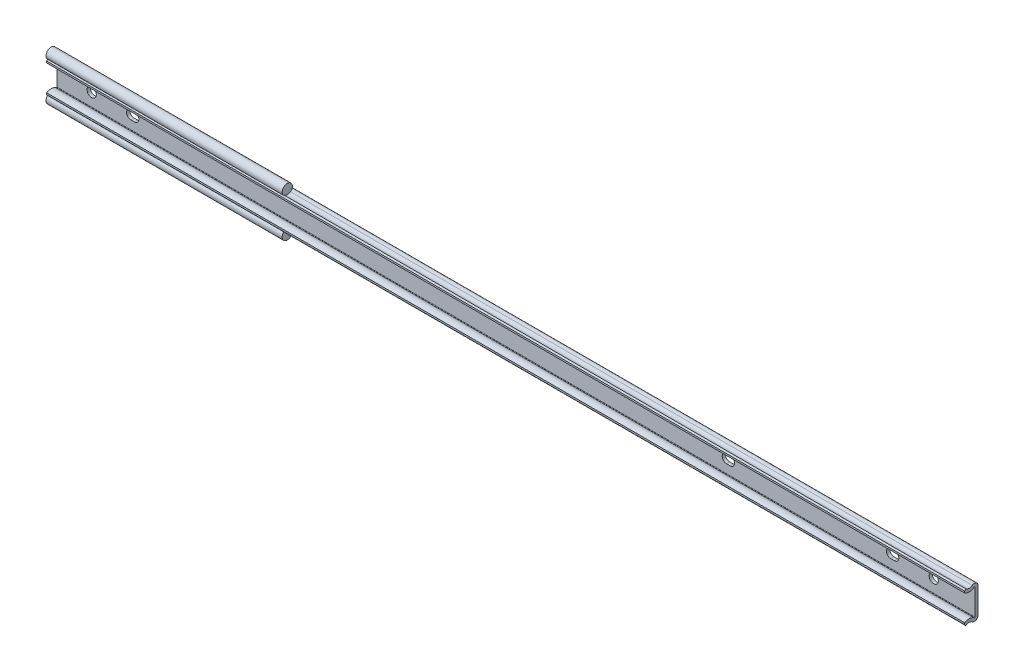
ISO-10303-21;
HEADER;
FILE_DESCRIPTION(('STEP AP214'),'2;1');
FILE_NAME('part.step','',(''),(''),'','','');
FILE_SCHEMA(('AUTOMOTIVE_DESIGN { 1 0 10303 214 1 1 1 1 }'));
ENDSEC;
DATA;
#1=APPLICATION_CONTEXT('core data for automotive mechanical design processes');
#2=APPLICATION_PROTOCOL_DEFINITION('international standard','automotive_design',2000,#1);
#3=PRODUCT_CONTEXT('',#1,'mechanical');
#4=PRODUCT('Part','Part','',(#3));
#5=PRODUCT_RELATED_PRODUCT_CATEGORY('part','',(#4));
#6=PRODUCT_DEFINITION_FORMATION('','',#4);
#7=PRODUCT_DEFINITION_CONTEXT('part definition',#1,'design');
#8=PRODUCT_DEFINITION('design','',#6,#7);
#9=PRODUCT_DEFINITION_SHAPE('','',#8);
#10=(LENGTH_UNIT() NAMED_UNIT(*) SI_UNIT(.MILLI.,.METRE.));
#11=(NAMED_UNIT(*) PLANE_ANGLE_UNIT() SI_UNIT($,.RADIAN.));
#12=(NAMED_UNIT(*) SI_UNIT($,.STERADIAN.) SOLID_ANGLE_UNIT());
#13=UNCERTAINTY_MEASURE_WITH_UNIT(LENGTH_MEASURE(1.E-05),#10,'distance_accuracy_value','');
#14=(GEOMETRIC_REPRESENTATION_CONTEXT(3) GLOBAL_UNCERTAINTY_ASSIGNED_CONTEXT((#13)) GLOBAL_UNIT_ASSIGNED_CONTEXT((#10,
#11,#12)) REPRESENTATION_CONTEXT('',''));
#15=CARTESIAN_POINT('',(0.,0.,0.));
#16=DIRECTION('',(0.,0.,1.));
#17=DIRECTION('',(1.,0.,0.));
#18=AXIS2_PLACEMENT_3D('',#15,#16,#17);
#19=CARTESIAN_POINT('',(430.,9.66999972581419,4.30999993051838));
#20=DIRECTION('',(-1.,0.,0.));
#21=DIRECTION('',(0.,0.,1.));
#22=AXIS2_PLACEMENT_3D('',#19,#20,#21);
#23=CYLINDRICAL_SURFACE('',#22,2.48000011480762);
#24=CARTESIAN_POINT('',(98.,9.66999972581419,4.3099999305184));
#25=DIRECTION('',(-1.,0.,0.));
#26=DIRECTION('',(0.,0.,1.));
#27=AXIS2_PLACEMENT_3D('',#24,#25,#26);
#28=CIRCLE('',#27,2.48000011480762);
#29=CARTESIAN_POINT('',(98.,7.77020940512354,5.90411325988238));
#30=VERTEX_POINT('',#29);
#31=CARTESIAN_POINT('',(98.,7.69573912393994,2.80910165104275));
#32=VERTEX_POINT('',#31);
#33=EDGE_CURVE('E251',#30,#32,#28,.F.);
#34=ORIENTED_EDGE('',*,*,#33,.F.);
#35=DIRECTION('',(-1.,0.,0.));
#36=VECTOR('',#35,1.);
#37=CARTESIAN_POINT('',(430.,7.77020940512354,5.90411325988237));
#38=LINE('',#37,#36);
#39=CARTESIAN_POINT('',(430.,7.77020940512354,5.90411325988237));
#40=VERTEX_POINT('',#39);
#41=EDGE_CURVE('E415',#40,#30,#38,.T.);
#42=ORIENTED_EDGE('',*,*,#41,.F.);
#43=CARTESIAN_POINT('',(430.,9.66999972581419,4.30999993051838));
#44=DIRECTION('',(-1.,0.,0.));
#45=DIRECTION('',(0.,0.,-1.));
#46=AXIS2_PLACEMENT_3D('',#43,#44,#45);
#47=CIRCLE('',#46,2.48000011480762);
#48=CARTESIAN_POINT('',(430.,7.69573912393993,2.80910165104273));
#49=VERTEX_POINT('',#48);
#50=EDGE_CURVE('E389',#49,#40,#47,.T.);
#51=ORIENTED_EDGE('',*,*,#50,.F.);
#52=DIRECTION('',(-1.,0.,0.));
#53=VECTOR('',#52,1.);
#54=CARTESIAN_POINT('',(430.,7.69573912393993,2.80910165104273));
#55=LINE('',#54,#53);
#56=EDGE_CURVE('E418',#49,#32,#55,.T.);
#57=ORIENTED_EDGE('',*,*,#56,.T.);
#58=EDGE_LOOP('',(#34,#42,#51,#57));
#59=FACE_BOUND('',#58,.T.);
#60=ADVANCED_FACE('F14',(#59),#23,.F.);
#61=CARTESIAN_POINT('',(430.,-9.66999990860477,4.30999993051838));
#62=DIRECTION('',(-1.,0.,0.));
#63=DIRECTION('',(0.,0.,1.));
#64=AXIS2_PLACEMENT_3D('',#61,#62,#63);
#65=CYLINDRICAL_SURFACE('',#64,4.03000011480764);
#66=DIRECTION('',(-1.,0.,0.));
#67=VECTOR('',#66,1.);
#68=CARTESIAN_POINT('',(430.,-6.46182654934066,1.87104018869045));
#69=LINE('',#68,#67);
#70=CARTESIAN_POINT('',(430.,-6.46182654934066,1.87104018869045));
#71=VERTEX_POINT('',#70);
#72=CARTESIAN_POINT('',(-17.,-6.46182654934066,1.87104018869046));
#73=VERTEX_POINT('',#72);
#74=EDGE_CURVE('E403',#71,#73,#69,.T.);
#75=ORIENTED_EDGE('',*,*,#74,.T.);
#76=CARTESIAN_POINT('',(-17.,-9.66999990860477,4.3099999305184));
#77=DIRECTION('',(-1.,0.,0.));
#78=DIRECTION('',(0.,0.,1.));
#79=AXIS2_PLACEMENT_3D('',#76,#77,#78);
#80=CIRCLE('',#79,4.03000011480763);
#81=CARTESIAN_POINT('',(-17.,-6.26775055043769,6.4699999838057));
#82=VERTEX_POINT('',#81);
#83=EDGE_CURVE('E259',#82,#73,#80,.T.);
#84=ORIENTED_EDGE('',*,*,#83,.F.);
#85=DIRECTION('',(-1.,0.,0.));
#86=VECTOR('',#85,1.);
#87=CARTESIAN_POINT('',(430.,-6.26775055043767,6.4699999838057));
#88=LINE('',#87,#86);
#89=CARTESIAN_POINT('',(430.,-6.26775055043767,6.4699999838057));
#90=VERTEX_POINT('',#89);
#91=EDGE_CURVE('E433',#90,#82,#88,.T.);
#92=ORIENTED_EDGE('',*,*,#91,.F.);
#93=CARTESIAN_POINT('',(430.,-9.66999990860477,4.30999993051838));
#94=DIRECTION('',(1.,0.,0.));
#95=DIRECTION('',(0.,0.,1.));
#96=AXIS2_PLACEMENT_3D('',#93,#94,#95);
#97=CIRCLE('',#96,4.03000011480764);
#98=EDGE_CURVE('E374',#71,#90,#97,.T.);
#99=ORIENTED_EDGE('',*,*,#98,.F.);
#100=EDGE_LOOP('',(#75,#84,#92,#99));
#101=FACE_BOUND('',#100,.T.);
#102=ADVANCED_FACE('F16',(#101),#65,.T.);
#103=CARTESIAN_POINT('',(430.,-6.26775055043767,6.4699999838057));
#104=DIRECTION('',(0.,0.,-1.));
#105=DIRECTION('',(-1.,0.,0.));
#106=AXIS2_PLACEMENT_3D('',#103,#104,#105);
#107=PLANE('',#106);
#108=ORIENTED_EDGE('',*,*,#91,.T.);
#109=DIRECTION('',(0.,1.,0.));
#110=VECTOR('',#109,1.);
#111=CARTESIAN_POINT('',(-17.,-7.09581181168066,6.46999998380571));
#112=LINE('',#111,#110);
#113=CARTESIAN_POINT('',(-17.,-7.09581181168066,6.46999998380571));
#114=VERTEX_POINT('',#113);
#115=EDGE_CURVE('E289',#114,#82,#112,.T.);
#116=ORIENTED_EDGE('',*,*,#115,.F.);
#117=DIRECTION('',(-1.,0.,0.));
#118=VECTOR('',#117,1.);
#119=CARTESIAN_POINT('',(430.,-7.09581181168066,6.4699999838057));
#120=LINE('',#119,#118);
#121=CARTESIAN_POINT('',(430.,-7.09581181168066,6.4699999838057));
#122=VERTEX_POINT('',#121);
#123=EDGE_CURVE('E431',#122,#114,#120,.T.);
#124=ORIENTED_EDGE('',*,*,#123,.F.);
#125=DIRECTION('',(0.,-1.,0.));
#126=VECTOR('',#125,1.);
#127=CARTESIAN_POINT('',(430.,-6.26775055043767,6.4699999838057));
#128=LINE('',#127,#126);
#129=EDGE_CURVE('E377',#90,#122,#128,.T.);
#130=ORIENTED_EDGE('',*,*,#129,.F.);
#131=EDGE_LOOP('',(#108,#116,#124,#130));
#132=FACE_BOUND('',#131,.T.);
#133=ADVANCED_FACE('F509',(#132),#107,.F.);
#134=CARTESIAN_POINT('',(430.,-7.77020958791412,5.90411325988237));
#135=DIRECTION('',(0.,0.642787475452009,-0.766044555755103));
#136=DIRECTION('',(0.,0.766044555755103,0.642787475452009));
#137=AXIS2_PLACEMENT_3D('',#134,#135,#136);
#138=PLANE('',#137);
#139=DIRECTION('',(0.,0.7660445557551,0.642787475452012));
#140=VECTOR('',#139,1.);
#141=CARTESIAN_POINT('',(-17.,-7.77020958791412,5.90411325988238));
#142=LINE('',#141,#140);
#143=CARTESIAN_POINT('',(-17.,-7.65539913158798,6.00045063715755));
#144=VERTEX_POINT('',#143);
#145=EDGE_CURVE('E234',#144,#114,#142,.T.);
#146=ORIENTED_EDGE('',*,*,#145,.F.);
#147=DIRECTION('',(-1.,0.,0.));
#148=VECTOR('',#147,1.);
#149=CARTESIAN_POINT('',(98.,-7.65539913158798,6.00045063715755));
#150=LINE('',#149,#148);
#151=CARTESIAN_POINT('',(98.,-7.65539913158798,6.00045063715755));
#152=VERTEX_POINT('',#151);
#153=EDGE_CURVE('E225',#144,#152,#150,.F.);
#154=ORIENTED_EDGE('',*,*,#153,.T.);
#155=DIRECTION('',(0.,-0.766044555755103,-0.642787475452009));
#156=VECTOR('',#155,1.);
#157=CARTESIAN_POINT('',(98.,-7.77020958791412,5.90411325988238));
#158=LINE('',#157,#156);
#159=CARTESIAN_POINT('',(98.,-7.77020958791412,5.90411325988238));
#160=VERTEX_POINT('',#159);
#161=EDGE_CURVE('E211',#152,#160,#158,.T.);
#162=ORIENTED_EDGE('',*,*,#161,.T.);
#163=DIRECTION('',(-1.,0.,0.));
#164=VECTOR('',#163,1.);
#165=CARTESIAN_POINT('',(430.,-7.77020958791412,5.90411325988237));
#166=LINE('',#165,#164);
#167=CARTESIAN_POINT('',(430.,-7.77020958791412,5.90411325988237));
#168=VERTEX_POINT('',#167);
#169=EDGE_CURVE('E429',#168,#160,#166,.T.);
#170=ORIENTED_EDGE('',*,*,#169,.F.);
#171=DIRECTION('',(0.,-0.766044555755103,-0.642787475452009));
#172=VECTOR('',#171,1.);
#173=CARTESIAN_POINT('',(430.,-7.77020958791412,5.90411325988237));
#174=LINE('',#173,#172);
#175=EDGE_CURVE('E379',#122,#168,#174,.T.);
#176=ORIENTED_EDGE('',*,*,#175,.F.);
#177=ORIENTED_EDGE('',*,*,#123,.T.);
#178=EDGE_LOOP('',(#146,#154,#162,#170,#176,#177));
#179=FACE_BOUND('',#178,.T.);
#180=ADVANCED_FACE('F232',(#179),#138,.F.);
#181=CARTESIAN_POINT('',(430.,-9.66999990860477,4.30999993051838));
#182=DIRECTION('',(-1.,0.,0.));
#183=DIRECTION('',(0.,0.,1.));
#184=AXIS2_PLACEMENT_3D('',#181,#182,#183);
#185=CYLINDRICAL_SURFACE('',#184,2.48000011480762);
#186=ORIENTED_EDGE('',*,*,#169,.T.);
#187=CARTESIAN_POINT('',(98.,-9.66999990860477,4.3099999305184));
#188=DIRECTION('',(1.,0.,0.));
#189=DIRECTION('',(0.,0.,-1.));
#190=AXIS2_PLACEMENT_3D('',#187,#188,#189);
#191=CIRCLE('',#190,2.48000011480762);
#192=CARTESIAN_POINT('',(98.,-7.69573930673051,2.80910165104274));
#193=VERTEX_POINT('',#192);
#194=EDGE_CURVE('E216',#160,#193,#191,.F.);
#195=ORIENTED_EDGE('',*,*,#194,.T.);
#196=DIRECTION('',(-1.,0.,0.));
#197=VECTOR('',#196,1.);
#198=CARTESIAN_POINT('',(430.,-7.69573930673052,2.80910165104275));
#199=LINE('',#198,#197);
#200=CARTESIAN_POINT('',(430.,-7.69573930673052,2.80910165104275));
#201=VERTEX_POINT('',#200);
#202=EDGE_CURVE('E426',#201,#193,#199,.T.);
#203=ORIENTED_EDGE('',*,*,#202,.F.);
#204=CARTESIAN_POINT('',(430.,-9.66999990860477,4.30999993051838));
#205=DIRECTION('',(-1.,0.,0.));
#206=DIRECTION('',(0.,0.,1.));
#207=AXIS2_PLACEMENT_3D('',#204,#205,#206);
#208=CIRCLE('',#207,2.48000011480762);
#209=EDGE_CURVE('E381',#168,#201,#208,.T.);
#210=ORIENTED_EDGE('',*,*,#209,.F.);
#211=EDGE_LOOP('',(#186,#195,#203,#210));
#212=FACE_BOUND('',#211,.T.);
#213=ADVANCED_FACE('F516',(#212),#185,.F.);
#214=CARTESIAN_POINT('',(430.,-6.302612,1.74999999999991));
#215=DIRECTION('',(-1.,0.,0.));
#216=DIRECTION('',(0.,0.,1.));
#217=AXIS2_PLACEMENT_3D('',#214,#215,#216);
#218=CYLINDRICAL_SURFACE('',#217,1.74999999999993);
#219=CARTESIAN_POINT('',(98.,-6.302612,1.74999999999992));
#220=DIRECTION('',(1.,0.,0.));
#221=DIRECTION('',(0.,0.,-1.));
#222=AXIS2_PLACEMENT_3D('',#219,#220,#221);
#223=CIRCLE('',#222,1.74999999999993);
#224=CARTESIAN_POINT('',(98.,-7.94495173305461,2.3543345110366));
#225=VERTEX_POINT('',#224);
#226=EDGE_CURVE('E9',#193,#225,#223,.T.);
#227=ORIENTED_EDGE('',*,*,#226,.T.);
#228=DIRECTION('',(-1.,0.,0.));
#229=VECTOR('',#228,1.);
#230=CARTESIAN_POINT('',(40.5,-7.94495173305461,2.3543345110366));
#231=LINE('',#230,#229);
#232=CARTESIAN_POINT('',(-17.,-7.94495173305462,2.35433451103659));
#233=VERTEX_POINT('',#232);
#234=EDGE_CURVE('E228',#225,#233,#231,.T.);
#235=ORIENTED_EDGE('',*,*,#234,.T.);
#236=CARTESIAN_POINT('',(-17.,-6.302612,1.74999999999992));
#237=DIRECTION('',(-1.,0.,0.));
#238=DIRECTION('',(0.,0.,1.));
#239=AXIS2_PLACEMENT_3D('',#236,#237,#238);
#240=CIRCLE('',#239,1.74999999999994);
#241=CARTESIAN_POINT('',(-17.,-6.302612,0.));
#242=VERTEX_POINT('',#241);
#243=EDGE_CURVE('E285',#242,#233,#240,.T.);
#244=ORIENTED_EDGE('',*,*,#243,.F.);
#245=DIRECTION('',(-1.,0.,0.));
#246=VECTOR('',#245,1.);
#247=CARTESIAN_POINT('',(430.,-6.302612,0.));
#248=LINE('',#247,#246);
#249=CARTESIAN_POINT('',(430.,-6.302612,0.));
#250=VERTEX_POINT('',#249);
#251=EDGE_CURVE('E424',#250,#242,#248,.T.);
#252=ORIENTED_EDGE('',*,*,#251,.F.);
#253=CARTESIAN_POINT('',(430.,-6.302612,1.74999999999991));
#254=DIRECTION('',(1.,0.,0.));
#255=DIRECTION('',(0.,0.,1.));
#256=AXIS2_PLACEMENT_3D('',#253,#254,#255);
#257=CIRCLE('',#256,1.74999999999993);
#258=EDGE_CURVE('E383',#201,#250,#257,.T.);
#259=ORIENTED_EDGE('',*,*,#258,.F.);
#260=ORIENTED_EDGE('',*,*,#202,.T.);
#261=EDGE_LOOP('',(#227,#235,#244,#252,#259,#260));
#262=FACE_BOUND('',#261,.T.);
#263=ADVANCED_FACE('F518',(#262),#218,.T.);
#264=CARTESIAN_POINT('',(430.,-6.302612,0.));
#265=DIRECTION('',(0.,0.,1.));
#266=DIRECTION('',(1.,0.,0.));
#267=AXIS2_PLACEMENT_3D('',#264,#265,#266);
#268=PLANE('',#267);
#269=DIRECTION('',(0.999995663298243,-0.00294506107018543,0.));
#270=VECTOR('',#269,1.);
#271=CARTESIAN_POINT('',(19.1000019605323,2.10265056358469,0.));
#272=LINE('',#271,#270);
#273=CARTESIAN_POINT('',(19.1000019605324,2.10265056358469,0.));
#274=VERTEX_POINT('',#273);
#275=CARTESIAN_POINT('',(20.900000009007,2.09734943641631,0.));
#276=VERTEX_POINT('',#275);
#277=EDGE_CURVE('E325',#274,#276,#272,.T.);
#278=ORIENTED_EDGE('',*,*,#277,.F.);
#279=CARTESIAN_POINT('',(19.1000009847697,4.94396190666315E-13,0.));
#280=DIRECTION('',(0.,0.,-1.));
#281=DIRECTION('',(-1.,0.,0.));
#282=AXIS2_PLACEMENT_3D('',#279,#280,#281);
#283=CIRCLE('',#282,2.10265056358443);
#284=CARTESIAN_POINT('',(19.100000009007,-2.10265056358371,0.));
#285=VERTEX_POINT('',#284);
#286=EDGE_CURVE('E255',#285,#274,#283,.T.);
#287=ORIENTED_EDGE('',*,*,#286,.F.);
#288=DIRECTION('',(-1.,0.,0.));
#289=VECTOR('',#288,1.);
#290=CARTESIAN_POINT('',(20.900000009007,-2.1026505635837,0.));
#291=LINE('',#290,#289);
#292=CARTESIAN_POINT('',(20.900000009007,-2.1026505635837,0.));
#293=VERTEX_POINT('',#292);
#294=EDGE_CURVE('E331',#293,#285,#291,.T.);
#295=ORIENTED_EDGE('',*,*,#294,.F.);
#296=CARTESIAN_POINT('',(20.900000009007,-0.00265056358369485,0.));
#297=DIRECTION('',(0.,0.,-1.));
#298=DIRECTION('',(-1.,0.,0.));
#299=AXIS2_PLACEMENT_3D('',#296,#297,#298);
#300=CIRCLE('',#299,2.1);
#301=EDGE_CURVE('E328',#276,#293,#300,.T.);
#302=ORIENTED_EDGE('',*,*,#301,.F.);
#303=EDGE_LOOP('',(#278,#287,#295,#302));
#304=FACE_BOUND('',#303,.T.);
#305=DIRECTION('',(-1.,0.,0.));
#306=VECTOR('',#305,1.);
#307=CARTESIAN_POINT('',(310.9,-2.1,0.));
#308=LINE('',#307,#306);
#309=CARTESIAN_POINT('',(310.9,-2.1,0.));
#310=VERTEX_POINT('',#309);
#311=CARTESIAN_POINT('',(309.1,-2.1,0.));
#312=VERTEX_POINT('',#311);
#313=EDGE_CURVE('E300',#310,#312,#308,.T.);
#314=ORIENTED_EDGE('',*,*,#313,.F.);
#315=CARTESIAN_POINT('',(310.9,0.,0.));
#316=DIRECTION('',(0.,0.,-1.));
#317=DIRECTION('',(-1.,0.,0.));
#318=AXIS2_PLACEMENT_3D('',#315,#316,#317);
#319=CIRCLE('',#318,2.1);
#320=CARTESIAN_POINT('',(310.9,2.1,0.));
#321=VERTEX_POINT('',#320);
#322=EDGE_CURVE('E29',#321,#310,#319,.T.);
#323=ORIENTED_EDGE('',*,*,#322,.F.);
#324=DIRECTION('',(1.,0.,0.));
#325=VECTOR('',#324,1.);
#326=CARTESIAN_POINT('',(309.1,2.1,0.));
#327=LINE('',#326,#325);
#328=CARTESIAN_POINT('',(309.1,2.1,0.));
#329=VERTEX_POINT('',#328);
#330=EDGE_CURVE('E306',#329,#321,#327,.T.);
#331=ORIENTED_EDGE('',*,*,#330,.F.);
#332=CARTESIAN_POINT('',(309.1,0.,0.));
#333=DIRECTION('',(0.,0.,-1.));
#334=DIRECTION('',(-1.,0.,0.));
#335=AXIS2_PLACEMENT_3D('',#332,#333,#334);
#336=CIRCLE('',#335,2.1);
#337=EDGE_CURVE('E303',#312,#329,#336,.T.);
#338=ORIENTED_EDGE('',*,*,#337,.F.);
#339=EDGE_LOOP('',(#314,#323,#331,#338));
#340=FACE_BOUND('',#339,.T.);
#341=DIRECTION('',(-1.,0.,0.));
#342=VECTOR('',#341,1.);
#343=CARTESIAN_POINT('',(390.9,-2.1,0.));
#344=LINE('',#343,#342);
#345=CARTESIAN_POINT('',(390.9,-2.1,0.));
#346=VERTEX_POINT('',#345);
#347=CARTESIAN_POINT('',(389.1,-2.1,0.));
#348=VERTEX_POINT('',#347);
#349=EDGE_CURVE('E348',#346,#348,#344,.T.);
#350=ORIENTED_EDGE('',*,*,#349,.F.);
#351=CARTESIAN_POINT('',(390.9,0.,0.));
#352=DIRECTION('',(0.,0.,-1.));
#353=DIRECTION('',(-1.,0.,0.));
#354=AXIS2_PLACEMENT_3D('',#351,#352,#353);
#355=CIRCLE('',#354,2.1);
#356=CARTESIAN_POINT('',(390.9,2.1,0.));
#357=VERTEX_POINT('',#356);
#358=EDGE_CURVE('E346',#357,#346,#355,.T.);
#359=ORIENTED_EDGE('',*,*,#358,.F.);
#360=DIRECTION('',(1.,0.,0.));
#361=VECTOR('',#360,1.);
#362=CARTESIAN_POINT('',(390.9,2.1,0.));
#363=LINE('',#362,#361);
#364=CARTESIAN_POINT('',(389.1,2.1,0.));
#365=VERTEX_POINT('',#364);
#366=EDGE_CURVE('E354',#365,#357,#363,.T.);
#367=ORIENTED_EDGE('',*,*,#366,.F.);
#368=CARTESIAN_POINT('',(389.1,0.,0.));
#369=DIRECTION('',(0.,0.,-1.));
#370=DIRECTION('',(-1.,0.,0.));
#371=AXIS2_PLACEMENT_3D('',#368,#369,#370);
#372=CIRCLE('',#371,2.1);
#373=EDGE_CURVE('E351',#348,#365,#372,.T.);
#374=ORIENTED_EDGE('',*,*,#373,.F.);
#375=EDGE_LOOP('',(#350,#359,#367,#374));
#376=FACE_BOUND('',#375,.T.);
#377=CARTESIAN_POINT('',(410.,0.,0.));
#378=DIRECTION('',(0.,0.,-1.));
#379=DIRECTION('',(-1.,0.,0.));
#380=AXIS2_PLACEMENT_3D('',#377,#378,#379);
#381=CIRCLE('',#380,2.24999999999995);
#382=CARTESIAN_POINT('',(407.75,0.,0.));
#383=VERTEX_POINT('',#382);
#384=EDGE_CURVE('E360',#383,#383,#381,.T.);
#385=ORIENTED_EDGE('',*,*,#384,.F.);
#386=EDGE_LOOP('',(#385));
#387=FACE_BOUND('',#386,.T.);
#388=CARTESIAN_POINT('',(0.,0.,0.));
#389=DIRECTION('',(0.,0.,-1.));
#390=DIRECTION('',(-1.,0.,0.));
#391=AXIS2_PLACEMENT_3D('',#388,#389,#390);
#392=CIRCLE('',#391,2.25);
#393=CARTESIAN_POINT('',(-2.25,0.,0.));
#394=VERTEX_POINT('',#393);
#395=EDGE_CURVE('E370',#394,#394,#392,.T.);
#396=ORIENTED_EDGE('',*,*,#395,.F.);
#397=EDGE_LOOP('',(#396));
#398=FACE_BOUND('',#397,.T.);
#399=ORIENTED_EDGE('',*,*,#251,.T.);
#400=DIRECTION('',(0.,-1.,0.));
#401=VECTOR('',#400,1.);
#402=CARTESIAN_POINT('',(-17.,6.30261181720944,0.));
#403=LINE('',#402,#401);
#404=CARTESIAN_POINT('',(-17.,6.30261181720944,0.));
#405=VERTEX_POINT('',#404);
#406=EDGE_CURVE('E282',#405,#242,#403,.T.);
#407=ORIENTED_EDGE('',*,*,#406,.F.);
#408=DIRECTION('',(-1.,0.,0.));
#409=VECTOR('',#408,1.);
#410=CARTESIAN_POINT('',(430.,6.30261181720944,0.));
#411=LINE('',#410,#409);
#412=CARTESIAN_POINT('',(430.,6.30261181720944,0.));
#413=VERTEX_POINT('',#412);
#414=EDGE_CURVE('E421',#413,#405,#411,.T.);
#415=ORIENTED_EDGE('',*,*,#414,.F.);
#416=DIRECTION('',(0.,1.,0.));
#417=VECTOR('',#416,1.);
#418=CARTESIAN_POINT('',(430.,-6.302612,0.));
#419=LINE('',#418,#417);
#420=EDGE_CURVE('E385',#250,#413,#419,.T.);
#421=ORIENTED_EDGE('',*,*,#420,.F.);
#422=EDGE_LOOP('',(#399,#407,#415,#421));
#423=FACE_BOUND('',#422,.T.);
#424=ADVANCED_FACE('F522',(#304,#340,#376,#387,#398,#423),#268,.F.);
#425=CARTESIAN_POINT('',(430.,6.30261181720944,1.74999999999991));
#426=DIRECTION('',(-1.,0.,0.));
#427=DIRECTION('',(0.,0.,1.));
#428=AXIS2_PLACEMENT_3D('',#425,#426,#427);
#429=CYLINDRICAL_SURFACE('',#428,1.74999999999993);
#430=CARTESIAN_POINT('',(-17.,6.30261181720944,1.74999999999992));
#431=DIRECTION('',(-1.,0.,0.));
#432=DIRECTION('',(0.,0.,1.));
#433=AXIS2_PLACEMENT_3D('',#430,#431,#432);
#434=CIRCLE('',#433,1.74999999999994);
#435=CARTESIAN_POINT('',(-17.,7.94495155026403,2.3543345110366));
#436=VERTEX_POINT('',#435);
#437=EDGE_CURVE('E280',#436,#405,#434,.T.);
#438=ORIENTED_EDGE('',*,*,#437,.F.);
#439=DIRECTION('',(-1.,0.,0.));
#440=VECTOR('',#439,1.);
#441=CARTESIAN_POINT('',(40.5,7.94495155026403,2.3543345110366));
#442=LINE('',#441,#440);
#443=CARTESIAN_POINT('',(98.,7.94495155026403,2.3543345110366));
#444=VERTEX_POINT('',#443);
#445=EDGE_CURVE('E248',#436,#444,#442,.F.);
#446=ORIENTED_EDGE('',*,*,#445,.T.);
#447=CARTESIAN_POINT('',(98.,6.30261181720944,1.74999999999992));
#448=DIRECTION('',(-1.,0.,0.));
#449=DIRECTION('',(0.,0.,1.));
#450=AXIS2_PLACEMENT_3D('',#447,#448,#449);
#451=CIRCLE('',#450,1.74999999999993);
#452=EDGE_CURVE('E253',#32,#444,#451,.T.);
#453=ORIENTED_EDGE('',*,*,#452,.F.);
#454=ORIENTED_EDGE('',*,*,#56,.F.);
#455=CARTESIAN_POINT('',(430.,6.30261181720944,1.74999999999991));
#456=DIRECTION('',(1.,0.,0.));
#457=DIRECTION('',(0.,0.,-1.));
#458=AXIS2_PLACEMENT_3D('',#455,#456,#457);
#459=CIRCLE('',#458,1.74999999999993);
#460=EDGE_CURVE('E387',#413,#49,#459,.T.);
#461=ORIENTED_EDGE('',*,*,#460,.F.);
#462=ORIENTED_EDGE('',*,*,#414,.T.);
#463=EDGE_LOOP('',(#438,#446,#453,#454,#461,#462));
#464=FACE_BOUND('',#463,.T.);
#465=ADVANCED_FACE('F474',(#464),#429,.T.);
#466=CARTESIAN_POINT('',(430.,7.77020940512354,5.90411325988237));
#467=DIRECTION('',(0.,-0.642787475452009,-0.766044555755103));
#468=DIRECTION('',(0.,0.766044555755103,-0.642787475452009));
#469=AXIS2_PLACEMENT_3D('',#466,#467,#468);
#470=PLANE('',#469);
#471=DIRECTION('',(0.,0.766044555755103,-0.642787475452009));
#472=VECTOR('',#471,1.);
#473=CARTESIAN_POINT('',(98.,7.77020940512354,5.90411325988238));
#474=LINE('',#473,#472);
#475=CARTESIAN_POINT('',(98.,7.6553989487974,6.00045063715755));
#476=VERTEX_POINT('',#475);
#477=EDGE_CURVE('E22',#476,#30,#474,.T.);
#478=ORIENTED_EDGE('',*,*,#477,.F.);
#479=DIRECTION('',(-1.,0.,0.));
#480=VECTOR('',#479,1.);
#481=CARTESIAN_POINT('',(98.,7.6553989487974,6.00045063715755));
#482=LINE('',#481,#480);
#483=CARTESIAN_POINT('',(-17.,7.6553989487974,6.00045063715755));
#484=VERTEX_POINT('',#483);
#485=EDGE_CURVE('E243',#476,#484,#482,.T.);
#486=ORIENTED_EDGE('',*,*,#485,.T.);
#487=DIRECTION('',(0.,0.7660445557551,-0.642787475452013));
#488=VECTOR('',#487,1.);
#489=CARTESIAN_POINT('',(-17.,7.09581162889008,6.46999998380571));
#490=LINE('',#489,#488);
#491=CARTESIAN_POINT('',(-17.,7.09581162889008,6.46999998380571));
#492=VERTEX_POINT('',#491);
#493=EDGE_CURVE('E277',#492,#484,#490,.T.);
#494=ORIENTED_EDGE('',*,*,#493,.F.);
#495=DIRECTION('',(-1.,0.,0.));
#496=VECTOR('',#495,1.);
#497=CARTESIAN_POINT('',(430.,7.09581162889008,6.4699999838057));
#498=LINE('',#497,#496);
#499=CARTESIAN_POINT('',(430.,7.09581162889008,6.4699999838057));
#500=VERTEX_POINT('',#499);
#501=EDGE_CURVE('E413',#500,#492,#498,.T.);
#502=ORIENTED_EDGE('',*,*,#501,.F.);
#503=DIRECTION('',(0.,-0.766044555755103,0.642787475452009));
#504=VECTOR('',#503,1.);
#505=CARTESIAN_POINT('',(430.,7.77020940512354,5.90411325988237));
#506=LINE('',#505,#504);
#507=EDGE_CURVE('E391',#40,#500,#506,.T.);
#508=ORIENTED_EDGE('',*,*,#507,.F.);
#509=ORIENTED_EDGE('',*,*,#41,.T.);
#510=EDGE_LOOP('',(#478,#486,#494,#502,#508,#509));
#511=FACE_BOUND('',#510,.T.);
#512=ADVANCED_FACE('F462',(#511),#470,.F.);
#513=CARTESIAN_POINT('',(430.,6.26775036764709,6.4699999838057));
#514=DIRECTION('',(0.,0.,-1.));
#515=DIRECTION('',(-1.,0.,0.));
#516=AXIS2_PLACEMENT_3D('',#513,#514,#515);
#517=PLANE('',#516);
#518=ORIENTED_EDGE('',*,*,#501,.T.);
#519=DIRECTION('',(0.,1.,0.));
#520=VECTOR('',#519,1.);
#521=CARTESIAN_POINT('',(-17.,6.26775036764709,6.46999998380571));
#522=LINE('',#521,#520);
#523=CARTESIAN_POINT('',(-17.,6.26775036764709,6.46999998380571));
#524=VERTEX_POINT('',#523);
#525=EDGE_CURVE('E274',#524,#492,#522,.T.);
#526=ORIENTED_EDGE('',*,*,#525,.F.);
#527=DIRECTION('',(-1.,0.,0.));
#528=VECTOR('',#527,1.);
#529=CARTESIAN_POINT('',(430.,6.26775036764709,6.4699999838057));
#530=LINE('',#529,#528);
#531=CARTESIAN_POINT('',(430.,6.26775036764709,6.4699999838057));
#532=VERTEX_POINT('',#531);
#533=EDGE_CURVE('E411',#532,#524,#530,.T.);
#534=ORIENTED_EDGE('',*,*,#533,.F.);
#535=DIRECTION('',(0.,-1.,0.));
#536=VECTOR('',#535,1.);
#537=CARTESIAN_POINT('',(430.,6.26775036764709,6.4699999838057));
#538=LINE('',#537,#536);
#539=EDGE_CURVE('E393',#500,#532,#538,.T.);
#540=ORIENTED_EDGE('',*,*,#539,.F.);
#541=EDGE_LOOP('',(#518,#526,#534,#540));
#542=FACE_BOUND('',#541,.T.);
#543=ADVANCED_FACE('F482',(#542),#517,.F.);
#544=CARTESIAN_POINT('',(430.,9.66999972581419,4.30999993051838));
#545=DIRECTION('',(-1.,0.,0.));
#546=DIRECTION('',(0.,0.,1.));
#547=AXIS2_PLACEMENT_3D('',#544,#545,#546);
#548=CYLINDRICAL_SURFACE('',#547,4.03000011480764);
#549=ORIENTED_EDGE('',*,*,#533,.T.);
#550=CARTESIAN_POINT('',(-17.,9.66999972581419,4.3099999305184));
#551=DIRECTION('',(-1.,0.,0.));
#552=DIRECTION('',(0.,0.,1.));
#553=AXIS2_PLACEMENT_3D('',#550,#551,#552);
#554=CIRCLE('',#553,4.03000011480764);
#555=CARTESIAN_POINT('',(-17.,6.46182636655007,1.87104018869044));
#556=VERTEX_POINT('',#555);
#557=EDGE_CURVE('E271',#556,#524,#554,.T.);
#558=ORIENTED_EDGE('',*,*,#557,.F.);
#559=DIRECTION('',(-1.,0.,0.));
#560=VECTOR('',#559,1.);
#561=CARTESIAN_POINT('',(430.,6.46182636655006,1.87104018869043));
#562=LINE('',#561,#560);
#563=CARTESIAN_POINT('',(430.,6.46182636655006,1.87104018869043));
#564=VERTEX_POINT('',#563);
#565=EDGE_CURVE('E409',#564,#556,#562,.T.);
#566=ORIENTED_EDGE('',*,*,#565,.F.);
#567=CARTESIAN_POINT('',(430.,9.66999972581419,4.30999993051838));
#568=DIRECTION('',(1.,0.,0.));
#569=DIRECTION('',(0.,0.,-1.));
#570=AXIS2_PLACEMENT_3D('',#567,#568,#569);
#571=CIRCLE('',#570,4.03000011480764);
#572=EDGE_CURVE('E395',#532,#564,#571,.T.);
#573=ORIENTED_EDGE('',*,*,#572,.F.);
#574=EDGE_LOOP('',(#549,#558,#566,#573));
#575=FACE_BOUND('',#574,.T.);
#576=ADVANCED_FACE('F486',(#575),#548,.T.);
#577=CARTESIAN_POINT('',(430.,6.30261181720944,1.74999999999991));
#578=DIRECTION('',(-1.,0.,0.));
#579=DIRECTION('',(0.,0.,1.));
#580=AXIS2_PLACEMENT_3D('',#577,#578,#579);
#581=CYLINDRICAL_SURFACE('',#580,0.199999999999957);
#582=ORIENTED_EDGE('',*,*,#565,.T.);
#583=CARTESIAN_POINT('',(-17.,6.30261181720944,1.74999999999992));
#584=DIRECTION('',(1.,0.,0.));
#585=DIRECTION('',(0.,0.,1.));
#586=AXIS2_PLACEMENT_3D('',#583,#584,#585);
#587=CIRCLE('',#586,0.199999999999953);
#588=CARTESIAN_POINT('',(-17.,6.30261181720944,1.54999999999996));
#589=VERTEX_POINT('',#588);
#590=EDGE_CURVE('E268',#589,#556,#587,.T.);
#591=ORIENTED_EDGE('',*,*,#590,.F.);
#592=DIRECTION('',(-1.,0.,0.));
#593=VECTOR('',#592,1.);
#594=CARTESIAN_POINT('',(430.,6.30261181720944,1.54999999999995));
#595=LINE('',#594,#593);
#596=CARTESIAN_POINT('',(430.,6.30261181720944,1.54999999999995));
#597=VERTEX_POINT('',#596);
#598=EDGE_CURVE('E407',#597,#589,#595,.T.);
#599=ORIENTED_EDGE('',*,*,#598,.F.);
#600=CARTESIAN_POINT('',(430.,6.30261181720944,1.74999999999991));
#601=DIRECTION('',(-1.,0.,0.));
#602=DIRECTION('',(0.,0.,-1.));
#603=AXIS2_PLACEMENT_3D('',#600,#601,#602);
#604=CIRCLE('',#603,0.199999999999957);
#605=EDGE_CURVE('E397',#564,#597,#604,.T.);
#606=ORIENTED_EDGE('',*,*,#605,.F.);
#607=EDGE_LOOP('',(#582,#591,#599,#606));
#608=FACE_BOUND('',#607,.T.);
#609=ADVANCED_FACE('F493',(#608),#581,.F.);
#610=CARTESIAN_POINT('',(430.,-6.302612,1.54999999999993));
#611=DIRECTION('',(0.,0.,-1.));
#612=DIRECTION('',(-1.,0.,0.));
#613=AXIS2_PLACEMENT_3D('',#610,#611,#612);
#614=PLANE('',#613);
#615=DIRECTION('',(1.,0.,0.));
#616=VECTOR('',#615,1.);
#617=CARTESIAN_POINT('',(20.900000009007,-2.1026505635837,1.54999999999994));
#618=LINE('',#617,#616);
#619=CARTESIAN_POINT('',(19.100000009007,-2.1026505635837,1.54999999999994));
#620=VERTEX_POINT('',#619);
#621=CARTESIAN_POINT('',(20.900000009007,-2.1026505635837,1.54999999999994));
#622=VERTEX_POINT('',#621);
#623=EDGE_CURVE('E322',#620,#622,#618,.T.);
#624=ORIENTED_EDGE('',*,*,#623,.F.);
#625=CARTESIAN_POINT('',(19.1000009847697,4.94396190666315E-13,1.54999999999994));
#626=DIRECTION('',(0.,0.,-1.));
#627=DIRECTION('',(-1.,0.,0.));
#628=AXIS2_PLACEMENT_3D('',#625,#626,#627);
#629=CIRCLE('',#628,2.10265056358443);
#630=CARTESIAN_POINT('',(19.100000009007,2.10265056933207,1.54999999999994));
#631=VERTEX_POINT('',#630);
#632=EDGE_CURVE('E257',#631,#620,#629,.F.);
#633=ORIENTED_EDGE('',*,*,#632,.F.);
#634=DIRECTION('',(-0.999995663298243,0.00294506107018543,0.));
#635=VECTOR('',#634,1.);
#636=CARTESIAN_POINT('',(19.1000019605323,2.10265056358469,1.54999999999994));
#637=LINE('',#636,#635);
#638=CARTESIAN_POINT('',(20.900000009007,2.09734943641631,1.54999999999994));
#639=VERTEX_POINT('',#638);
#640=EDGE_CURVE('E337',#639,#631,#637,.T.);
#641=ORIENTED_EDGE('',*,*,#640,.F.);
#642=CARTESIAN_POINT('',(20.900000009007,-0.00265056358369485,1.54999999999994));
#643=DIRECTION('',(0.,0.,-1.));
#644=DIRECTION('',(-1.,0.,0.));
#645=AXIS2_PLACEMENT_3D('',#642,#643,#644);
#646=CIRCLE('',#645,2.1);
#647=EDGE_CURVE('E320',#622,#639,#646,.F.);
#648=ORIENTED_EDGE('',*,*,#647,.F.);
#649=EDGE_LOOP('',(#624,#633,#641,#648));
#650=FACE_BOUND('',#649,.T.);
#651=DIRECTION('',(-1.,0.,0.));
#652=VECTOR('',#651,1.);
#653=CARTESIAN_POINT('',(309.1,2.1,1.54999999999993));
#654=LINE('',#653,#652);
#655=CARTESIAN_POINT('',(310.9,2.1,1.54999999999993));
#656=VERTEX_POINT('',#655);
#657=CARTESIAN_POINT('',(309.1,2.1,1.54999999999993));
#658=VERTEX_POINT('',#657);
#659=EDGE_CURVE('E293',#656,#658,#654,.T.);
#660=ORIENTED_EDGE('',*,*,#659,.F.);
#661=CARTESIAN_POINT('',(310.9,0.,1.54999999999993));
#662=DIRECTION('',(0.,0.,-1.));
#663=DIRECTION('',(-1.,0.,0.));
#664=AXIS2_PLACEMENT_3D('',#661,#662,#663);
#665=CIRCLE('',#664,2.1);
#666=CARTESIAN_POINT('',(310.9,-2.1,1.54999999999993));
#667=VERTEX_POINT('',#666);
#668=EDGE_CURVE('E296',#667,#656,#665,.F.);
#669=ORIENTED_EDGE('',*,*,#668,.F.);
#670=DIRECTION('',(1.,0.,0.));
#671=VECTOR('',#670,1.);
#672=CARTESIAN_POINT('',(310.9,-2.1,1.54999999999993));
#673=LINE('',#672,#671);
#674=CARTESIAN_POINT('',(309.1,-2.1,1.54999999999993));
#675=VERTEX_POINT('',#674);
#676=EDGE_CURVE('E312',#675,#667,#673,.T.);
#677=ORIENTED_EDGE('',*,*,#676,.F.);
#678=CARTESIAN_POINT('',(309.1,0.,1.54999999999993));
#679=DIRECTION('',(0.,0.,-1.));
#680=DIRECTION('',(-1.,0.,0.));
#681=AXIS2_PLACEMENT_3D('',#678,#679,#680);
#682=CIRCLE('',#681,2.1);
#683=EDGE_CURVE('E37',#658,#675,#682,.F.);
#684=ORIENTED_EDGE('',*,*,#683,.F.);
#685=EDGE_LOOP('',(#660,#669,#677,#684));
#686=FACE_BOUND('',#685,.T.);
#687=DIRECTION('',(1.,0.,0.));
#688=VECTOR('',#687,1.);
#689=CARTESIAN_POINT('',(430.,2.1,1.54999999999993));
#690=LINE('',#689,#688);
#691=CARTESIAN_POINT('',(389.1,2.1,1.54999999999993));
#692=VERTEX_POINT('',#691);
#693=CARTESIAN_POINT('',(390.9,2.1,1.54999999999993));
#694=VERTEX_POINT('',#693);
#695=EDGE_CURVE('E445',#692,#694,#690,.T.);
#696=ORIENTED_EDGE('',*,*,#695,.T.);
#697=CARTESIAN_POINT('',(390.9,0.,1.54999999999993));
#698=DIRECTION('',(0.,0.,-1.));
#699=DIRECTION('',(-1.,0.,0.));
#700=AXIS2_PLACEMENT_3D('',#697,#698,#699);
#701=CIRCLE('',#700,2.1);
#702=CARTESIAN_POINT('',(390.9,-2.1,1.54999999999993));
#703=VERTEX_POINT('',#702);
#704=EDGE_CURVE('E448',#694,#703,#701,.T.);
#705=ORIENTED_EDGE('',*,*,#704,.T.);
#706=DIRECTION('',(-1.,0.,0.));
#707=VECTOR('',#706,1.);
#708=CARTESIAN_POINT('',(430.,-2.1,1.54999999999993));
#709=LINE('',#708,#707);
#710=CARTESIAN_POINT('',(389.1,-2.1,1.54999999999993));
#711=VERTEX_POINT('',#710);
#712=EDGE_CURVE('E435',#703,#711,#709,.T.);
#713=ORIENTED_EDGE('',*,*,#712,.T.);
#714=CARTESIAN_POINT('',(389.1,0.,1.54999999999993));
#715=DIRECTION('',(0.,0.,-1.));
#716=DIRECTION('',(-1.,0.,0.));
#717=AXIS2_PLACEMENT_3D('',#714,#715,#716);
#718=CIRCLE('',#717,2.1);
#719=EDGE_CURVE('E442',#711,#692,#718,.T.);
#720=ORIENTED_EDGE('',*,*,#719,.T.);
#721=EDGE_LOOP('',(#696,#705,#713,#720));
#722=FACE_BOUND('',#721,.T.);
#723=CARTESIAN_POINT('',(410.,0.,1.54999999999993));
#724=DIRECTION('',(0.,0.,-1.));
#725=DIRECTION('',(-1.,0.,0.));
#726=AXIS2_PLACEMENT_3D('',#723,#724,#725);
#727=CIRCLE('',#726,2.24999999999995);
#728=CARTESIAN_POINT('',(407.75,0.,1.54999999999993));
#729=VERTEX_POINT('',#728);
#730=EDGE_CURVE('E369',#729,#729,#727,.T.);
#731=ORIENTED_EDGE('',*,*,#730,.T.);
#732=EDGE_LOOP('',(#731));
#733=FACE_BOUND('',#732,.T.);
#734=CARTESIAN_POINT('',(0.,0.,1.54999999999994));
#735=DIRECTION('',(0.,0.,-1.));
#736=DIRECTION('',(-1.,0.,0.));
#737=AXIS2_PLACEMENT_3D('',#734,#735,#736);
#738=CIRCLE('',#737,2.25);
#739=CARTESIAN_POINT('',(-2.25,0.,1.54999999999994));
#740=VERTEX_POINT('',#739);
#741=EDGE_CURVE('E373',#740,#740,#738,.T.);
#742=ORIENTED_EDGE('',*,*,#741,.T.);
#743=EDGE_LOOP('',(#742));
#744=FACE_BOUND('',#743,.T.);
#745=ORIENTED_EDGE('',*,*,#598,.T.);
#746=DIRECTION('',(0.,1.,0.));
#747=VECTOR('',#746,1.);
#748=CARTESIAN_POINT('',(-17.,-6.302612,1.54999999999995));
#749=LINE('',#748,#747);
#750=CARTESIAN_POINT('',(-17.,-6.302612,1.54999999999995));
#751=VERTEX_POINT('',#750);
#752=EDGE_CURVE('E265',#751,#589,#749,.T.);
#753=ORIENTED_EDGE('',*,*,#752,.F.);
#754=DIRECTION('',(-1.,0.,0.));
#755=VECTOR('',#754,1.);
#756=CARTESIAN_POINT('',(430.,-6.302612,1.54999999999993));
#757=LINE('',#756,#755);
#758=CARTESIAN_POINT('',(430.,-6.302612,1.54999999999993));
#759=VERTEX_POINT('',#758);
#760=EDGE_CURVE('E405',#759,#751,#757,.T.);
#761=ORIENTED_EDGE('',*,*,#760,.F.);
#762=DIRECTION('',(0.,-1.,0.));
#763=VECTOR('',#762,1.);
#764=CARTESIAN_POINT('',(430.,-6.302612,1.54999999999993));
#765=LINE('',#764,#763);
#766=EDGE_CURVE('E399',#597,#759,#765,.T.);
#767=ORIENTED_EDGE('',*,*,#766,.F.);
#768=EDGE_LOOP('',(#745,#753,#761,#767));
#769=FACE_BOUND('',#768,.T.);
#770=ADVANCED_FACE('F496',(#650,#686,#722,#733,#744,#769),#614,.F.);
#771=CARTESIAN_POINT('',(430.,-6.302612,1.74999999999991));
#772=DIRECTION('',(-1.,0.,0.));
#773=DIRECTION('',(0.,0.,1.));
#774=AXIS2_PLACEMENT_3D('',#771,#772,#773);
#775=CYLINDRICAL_SURFACE('',#774,0.199999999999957);
#776=ORIENTED_EDGE('',*,*,#760,.T.);
#777=CARTESIAN_POINT('',(-17.,-6.302612,1.74999999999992));
#778=DIRECTION('',(1.,0.,0.));
#779=DIRECTION('',(0.,0.,1.));
#780=AXIS2_PLACEMENT_3D('',#777,#778,#779);
#781=CIRCLE('',#780,0.199999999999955);
#782=EDGE_CURVE('E262',#73,#751,#781,.T.);
#783=ORIENTED_EDGE('',*,*,#782,.F.);
#784=ORIENTED_EDGE('',*,*,#74,.F.);
#785=CARTESIAN_POINT('',(430.,-6.302612,1.74999999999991));
#786=DIRECTION('',(-1.,0.,0.));
#787=DIRECTION('',(0.,0.,1.));
#788=AXIS2_PLACEMENT_3D('',#785,#786,#787);
#789=CIRCLE('',#788,0.199999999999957);
#790=EDGE_CURVE('E401',#759,#71,#789,.T.);
#791=ORIENTED_EDGE('',*,*,#790,.F.);
#792=EDGE_LOOP('',(#776,#783,#784,#791));
#793=FACE_BOUND('',#792,.T.);
#794=ADVANCED_FACE('F501',(#793),#775,.F.);
#795=CARTESIAN_POINT('',(430.,-9.66999990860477,4.30999993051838));
#796=DIRECTION('',(-1.,0.,0.));
#797=DIRECTION('',(0.,0.,1.));
#798=AXIS2_PLACEMENT_3D('',#795,#796,#797);
#799=PLANE('',#798);
#800=ORIENTED_EDGE('',*,*,#98,.T.);
#801=ORIENTED_EDGE('',*,*,#129,.T.);
#802=ORIENTED_EDGE('',*,*,#175,.T.);
#803=ORIENTED_EDGE('',*,*,#209,.T.);
#804=ORIENTED_EDGE('',*,*,#258,.T.);
#805=ORIENTED_EDGE('',*,*,#420,.T.);
#806=ORIENTED_EDGE('',*,*,#460,.T.);
#807=ORIENTED_EDGE('',*,*,#50,.T.);
#808=ORIENTED_EDGE('',*,*,#507,.T.);
#809=ORIENTED_EDGE('',*,*,#539,.T.);
#810=ORIENTED_EDGE('',*,*,#572,.T.);
#811=ORIENTED_EDGE('',*,*,#605,.T.);
#812=ORIENTED_EDGE('',*,*,#766,.T.);
#813=ORIENTED_EDGE('',*,*,#790,.T.);
#814=EDGE_LOOP('',(#800,#801,#802,#803,#804,#805,#806,#807,#808,#809,#810,#811,#812,#813));
#815=FACE_BOUND('',#814,.T.);
#816=ADVANCED_FACE('F467',(#815),#799,.F.);
#817=CARTESIAN_POINT('',(0.,0.,6.46999998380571));
#818=DIRECTION('',(0.,0.,-1.));
#819=DIRECTION('',(-1.,0.,0.));
#820=AXIS2_PLACEMENT_3D('',#817,#818,#819);
#821=CYLINDRICAL_SURFACE('',#820,2.25);
#822=ORIENTED_EDGE('',*,*,#395,.T.);
#823=EDGE_LOOP('',(#822));
#824=FACE_BOUND('',#823,.T.);
#825=ORIENTED_EDGE('',*,*,#741,.F.);
#826=EDGE_LOOP('',(#825));
#827=FACE_BOUND('',#826,.T.);
#828=ADVANCED_FACE('F558',(#824,#827),#821,.F.);
#829=CARTESIAN_POINT('',(410.,0.,6.4699999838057));
#830=DIRECTION('',(0.,0.,-1.));
#831=DIRECTION('',(-1.,0.,0.));
#832=AXIS2_PLACEMENT_3D('',#829,#830,#831);
#833=CYLINDRICAL_SURFACE('',#832,2.24999999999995);
#834=ORIENTED_EDGE('',*,*,#384,.T.);
#835=EDGE_LOOP('',(#834));
#836=FACE_BOUND('',#835,.T.);
#837=ORIENTED_EDGE('',*,*,#730,.F.);
#838=EDGE_LOOP('',(#837));
#839=FACE_BOUND('',#838,.T.);
#840=ADVANCED_FACE('F561',(#836,#839),#833,.F.);
#841=CARTESIAN_POINT('',(390.9,0.,6.4699999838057));
#842=DIRECTION('',(0.,0.,-1.));
#843=DIRECTION('',(-1.,0.,0.));
#844=AXIS2_PLACEMENT_3D('',#841,#842,#843);
#845=CYLINDRICAL_SURFACE('',#844,2.1);
#846=DIRECTION('',(0.,0.,-1.));
#847=VECTOR('',#846,1.);
#848=CARTESIAN_POINT('',(390.9,2.1,6.4699999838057));
#849=LINE('',#848,#847);
#850=EDGE_CURVE('E358',#694,#357,#849,.T.);
#851=ORIENTED_EDGE('',*,*,#850,.T.);
#852=ORIENTED_EDGE('',*,*,#358,.T.);
#853=DIRECTION('',(0.,0.,-1.));
#854=VECTOR('',#853,1.);
#855=CARTESIAN_POINT('',(390.9,-2.1,6.4699999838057));
#856=LINE('',#855,#854);
#857=EDGE_CURVE('E357',#703,#346,#856,.T.);
#858=ORIENTED_EDGE('',*,*,#857,.F.);
#859=ORIENTED_EDGE('',*,*,#704,.F.);
#860=EDGE_LOOP('',(#851,#852,#858,#859));
#861=FACE_BOUND('',#860,.T.);
#862=ADVANCED_FACE('F565',(#861),#845,.F.);
#863=CARTESIAN_POINT('',(390.9,2.1,6.4699999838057));
#864=DIRECTION('',(0.,1.,0.));
#865=DIRECTION('',(1.,0.,0.));
#866=AXIS2_PLACEMENT_3D('',#863,#864,#865);
#867=PLANE('',#866);
#868=DIRECTION('',(0.,0.,-1.));
#869=VECTOR('',#868,1.);
#870=CARTESIAN_POINT('',(389.1,2.1,6.4699999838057));
#871=LINE('',#870,#869);
#872=EDGE_CURVE('E361',#692,#365,#871,.T.);
#873=ORIENTED_EDGE('',*,*,#872,.T.);
#874=ORIENTED_EDGE('',*,*,#366,.T.);
#875=ORIENTED_EDGE('',*,*,#850,.F.);
#876=ORIENTED_EDGE('',*,*,#695,.F.);
#877=EDGE_LOOP('',(#873,#874,#875,#876));
#878=FACE_BOUND('',#877,.T.);
#879=ADVANCED_FACE('F569',(#878),#867,.F.);
#880=CARTESIAN_POINT('',(389.1,0.,6.4699999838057));
#881=DIRECTION('',(0.,0.,-1.));
#882=DIRECTION('',(-1.,0.,0.));
#883=AXIS2_PLACEMENT_3D('',#880,#881,#882);
#884=CYLINDRICAL_SURFACE('',#883,2.1);
#885=DIRECTION('',(0.,0.,-1.));
#886=VECTOR('',#885,1.);
#887=CARTESIAN_POINT('',(389.1,-2.1,6.4699999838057));
#888=LINE('',#887,#886);
#889=EDGE_CURVE('E363',#711,#348,#888,.T.);
#890=ORIENTED_EDGE('',*,*,#889,.T.);
#891=ORIENTED_EDGE('',*,*,#373,.T.);
#892=ORIENTED_EDGE('',*,*,#872,.F.);
#893=ORIENTED_EDGE('',*,*,#719,.F.);
#894=EDGE_LOOP('',(#890,#891,#892,#893));
#895=FACE_BOUND('',#894,.T.);
#896=ADVANCED_FACE('F575',(#895),#884,.F.);
#897=CARTESIAN_POINT('',(390.9,-2.1,6.4699999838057));
#898=DIRECTION('',(0.,-1.,0.));
#899=DIRECTION('',(-1.,0.,0.));
#900=AXIS2_PLACEMENT_3D('',#897,#898,#899);
#901=PLANE('',#900);
#902=ORIENTED_EDGE('',*,*,#857,.T.);
#903=ORIENTED_EDGE('',*,*,#349,.T.);
#904=ORIENTED_EDGE('',*,*,#889,.F.);
#905=ORIENTED_EDGE('',*,*,#712,.F.);
#906=EDGE_LOOP('',(#902,#903,#904,#905));
#907=FACE_BOUND('',#906,.T.);
#908=ADVANCED_FACE('F571',(#907),#901,.F.);
#909=CARTESIAN_POINT('',(20.900000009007,-2.1026505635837,6.47099998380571));
#910=DIRECTION('',(0.,-1.,0.));
#911=DIRECTION('',(-1.,0.,0.));
#912=AXIS2_PLACEMENT_3D('',#909,#910,#911);
#913=PLANE('',#912);
#914=ORIENTED_EDGE('',*,*,#623,.T.);
#915=DIRECTION('',(0.,0.,-1.));
#916=VECTOR('',#915,1.);
#917=CARTESIAN_POINT('',(20.900000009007,-2.1026505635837,6.47099998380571));
#918=LINE('',#917,#916);
#919=EDGE_CURVE('E338',#622,#293,#918,.T.);
#920=ORIENTED_EDGE('',*,*,#919,.T.);
#921=ORIENTED_EDGE('',*,*,#294,.T.);
#922=DIRECTION('',(0.,0.,-1.));
#923=VECTOR('',#922,1.);
#924=CARTESIAN_POINT('',(19.100000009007,-2.1026505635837,6.47099998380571));
#925=LINE('',#924,#923);
#926=EDGE_CURVE('E335',#620,#285,#925,.T.);
#927=ORIENTED_EDGE('',*,*,#926,.F.);
#928=EDGE_LOOP('',(#914,#920,#921,#927));
#929=FACE_BOUND('',#928,.T.);
#930=ADVANCED_FACE('F574',(#929),#913,.F.);
#931=CARTESIAN_POINT('',(20.900000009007,-0.00265056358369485,6.47099998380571));
#932=DIRECTION('',(0.,0.,-1.));
#933=DIRECTION('',(-1.,0.,0.));
#934=AXIS2_PLACEMENT_3D('',#931,#932,#933);
#935=CYLINDRICAL_SURFACE('',#934,2.1);
#936=ORIENTED_EDGE('',*,*,#647,.T.);
#937=DIRECTION('',(0.,0.,-1.));
#938=VECTOR('',#937,1.);
#939=CARTESIAN_POINT('',(20.900000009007,2.09734943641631,6.47099998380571));
#940=LINE('',#939,#938);
#941=EDGE_CURVE('E340',#639,#276,#940,.T.);
#942=ORIENTED_EDGE('',*,*,#941,.T.);
#943=ORIENTED_EDGE('',*,*,#301,.T.);
#944=ORIENTED_EDGE('',*,*,#919,.F.);
#945=EDGE_LOOP('',(#936,#942,#943,#944));
#946=FACE_BOUND('',#945,.T.);
#947=ADVANCED_FACE('F587',(#946),#935,.F.);
#948=CARTESIAN_POINT('',(19.1000019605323,2.10265056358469,6.47099998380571));
#949=DIRECTION('',(0.00294506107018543,0.999995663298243,0.));
#950=DIRECTION('',(0.999995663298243,-0.00294506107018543,0.));
#951=AXIS2_PLACEMENT_3D('',#948,#949,#950);
#952=PLANE('',#951);
#953=ORIENTED_EDGE('',*,*,#640,.T.);
#954=DIRECTION('',(0.,0.,-1.));
#955=VECTOR('',#954,1.);
#956=CARTESIAN_POINT('',(19.1000019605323,2.10265056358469,6.47099998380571));
#957=LINE('',#956,#955);
#958=EDGE_CURVE('E334',#631,#274,#957,.T.);
#959=ORIENTED_EDGE('',*,*,#958,.T.);
#960=ORIENTED_EDGE('',*,*,#277,.T.);
#961=ORIENTED_EDGE('',*,*,#941,.F.);
#962=EDGE_LOOP('',(#953,#959,#960,#961));
#963=FACE_BOUND('',#962,.T.);
#964=ADVANCED_FACE('F583',(#963),#952,.F.);
#965=CARTESIAN_POINT('',(310.9,0.,6.4709999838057));
#966=DIRECTION('',(0.,0.,-1.));
#967=DIRECTION('',(-1.,0.,0.));
#968=AXIS2_PLACEMENT_3D('',#965,#966,#967);
#969=CYLINDRICAL_SURFACE('',#968,2.1);
#970=ORIENTED_EDGE('',*,*,#668,.T.);
#971=DIRECTION('',(0.,0.,-1.));
#972=VECTOR('',#971,1.);
#973=CARTESIAN_POINT('',(310.9,2.1,6.4709999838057));
#974=LINE('',#973,#972);
#975=EDGE_CURVE('E310',#656,#321,#974,.T.);
#976=ORIENTED_EDGE('',*,*,#975,.T.);
#977=ORIENTED_EDGE('',*,*,#322,.T.);
#978=DIRECTION('',(0.,0.,-1.));
#979=VECTOR('',#978,1.);
#980=CARTESIAN_POINT('',(310.9,-2.1,6.4709999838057));
#981=LINE('',#980,#979);
#982=EDGE_CURVE('E309',#667,#310,#981,.T.);
#983=ORIENTED_EDGE('',*,*,#982,.F.);
#984=EDGE_LOOP('',(#970,#976,#977,#983));
#985=FACE_BOUND('',#984,.T.);
#986=ADVANCED_FACE('F586',(#985),#969,.F.);
#987=CARTESIAN_POINT('',(309.1,2.1,6.4709999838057));
#988=DIRECTION('',(0.,1.,0.));
#989=DIRECTION('',(1.,0.,0.));
#990=AXIS2_PLACEMENT_3D('',#987,#988,#989);
#991=PLANE('',#990);
#992=ORIENTED_EDGE('',*,*,#659,.T.);
#993=DIRECTION('',(0.,0.,-1.));
#994=VECTOR('',#993,1.);
#995=CARTESIAN_POINT('',(309.1,2.1,6.4709999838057));
#996=LINE('',#995,#994);
#997=EDGE_CURVE('E313',#658,#329,#996,.T.);
#998=ORIENTED_EDGE('',*,*,#997,.T.);
#999=ORIENTED_EDGE('',*,*,#330,.T.);
#1000=ORIENTED_EDGE('',*,*,#975,.F.);
#1001=EDGE_LOOP('',(#992,#998,#999,#1000));
#1002=FACE_BOUND('',#1001,.T.);
#1003=ADVANCED_FACE('F597',(#1002),#991,.F.);
#1004=CARTESIAN_POINT('',(309.1,0.,6.4709999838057));
#1005=DIRECTION('',(0.,0.,-1.));
#1006=DIRECTION('',(-1.,0.,0.));
#1007=AXIS2_PLACEMENT_3D('',#1004,#1005,#1006);
#1008=CYLINDRICAL_SURFACE('',#1007,2.1);
#1009=ORIENTED_EDGE('',*,*,#683,.T.);
#1010=DIRECTION('',(0.,0.,-1.));
#1011=VECTOR('',#1010,1.);
#1012=CARTESIAN_POINT('',(309.1,-2.1,6.4709999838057));
#1013=LINE('',#1012,#1011);
#1014=EDGE_CURVE('E315',#675,#312,#1013,.T.);
#1015=ORIENTED_EDGE('',*,*,#1014,.T.);
#1016=ORIENTED_EDGE('',*,*,#337,.T.);
#1017=ORIENTED_EDGE('',*,*,#997,.F.);
#1018=EDGE_LOOP('',(#1009,#1015,#1016,#1017));
#1019=FACE_BOUND('',#1018,.T.);
#1020=ADVANCED_FACE('F601',(#1019),#1008,.F.);
#1021=CARTESIAN_POINT('',(310.9,-2.1,6.4709999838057));
#1022=DIRECTION('',(0.,-1.,0.));
#1023=DIRECTION('',(-1.,0.,0.));
#1024=AXIS2_PLACEMENT_3D('',#1021,#1022,#1023);
#1025=PLANE('',#1024);
#1026=ORIENTED_EDGE('',*,*,#676,.T.);
#1027=ORIENTED_EDGE('',*,*,#982,.T.);
#1028=ORIENTED_EDGE('',*,*,#313,.T.);
#1029=ORIENTED_EDGE('',*,*,#1014,.F.);
#1030=EDGE_LOOP('',(#1026,#1027,#1028,#1029));
#1031=FACE_BOUND('',#1030,.T.);
#1032=ADVANCED_FACE('F598',(#1031),#1025,.F.);
#1033=CARTESIAN_POINT('',(-17.,-9.66999990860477,4.3099999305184));
#1034=DIRECTION('',(-1.,0.,0.));
#1035=DIRECTION('',(0.,0.,1.));
#1036=AXIS2_PLACEMENT_3D('',#1033,#1034,#1035);
#1037=PLANE('',#1036);
#1038=CARTESIAN_POINT('',(-17.,-9.47000009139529,4.31));
#1039=DIRECTION('',(-1.,0.,0.));
#1040=DIRECTION('',(0.,0.,-1.));
#1041=AXIS2_PLACEMENT_3D('',#1038,#1039,#1040);
#1042=CIRCLE('',#1041,2.48);
#1043=EDGE_CURVE('E229',#233,#144,#1042,.T.);
#1044=ORIENTED_EDGE('',*,*,#1043,.T.);
#1045=ORIENTED_EDGE('',*,*,#145,.T.);
#1046=ORIENTED_EDGE('',*,*,#115,.T.);
#1047=ORIENTED_EDGE('',*,*,#83,.T.);
#1048=ORIENTED_EDGE('',*,*,#782,.T.);
#1049=ORIENTED_EDGE('',*,*,#752,.T.);
#1050=ORIENTED_EDGE('',*,*,#590,.T.);
#1051=ORIENTED_EDGE('',*,*,#557,.T.);
#1052=ORIENTED_EDGE('',*,*,#525,.T.);
#1053=ORIENTED_EDGE('',*,*,#493,.T.);
#1054=CARTESIAN_POINT('',(-17.,9.46999990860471,4.31));
#1055=DIRECTION('',(-1.,0.,0.));
#1056=DIRECTION('',(0.,0.,1.));
#1057=AXIS2_PLACEMENT_3D('',#1054,#1055,#1056);
#1058=CIRCLE('',#1057,2.48);
#1059=EDGE_CURVE('E221',#484,#436,#1058,.T.);
#1060=ORIENTED_EDGE('',*,*,#1059,.T.);
#1061=ORIENTED_EDGE('',*,*,#437,.T.);
#1062=ORIENTED_EDGE('',*,*,#406,.T.);
#1063=ORIENTED_EDGE('',*,*,#243,.T.);
#1064=EDGE_LOOP('',(#1044,#1045,#1046,#1047,#1048,#1049,#1050,#1051,#1052,#1053,#1060,#1061,
#1062,#1063));
#1065=FACE_BOUND('',#1064,.T.);
#1066=ADVANCED_FACE('F478',(#1065),#1037,.T.);
#1067=CARTESIAN_POINT('',(19.1000009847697,4.94396190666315E-13,6.47099998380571));
#1068=DIRECTION('',(0.,0.,-1.));
#1069=DIRECTION('',(-1.,0.,0.));
#1070=AXIS2_PLACEMENT_3D('',#1067,#1068,#1069);
#1071=CYLINDRICAL_SURFACE('',#1070,2.10265056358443);
#1072=ORIENTED_EDGE('',*,*,#286,.T.);
#1073=ORIENTED_EDGE('',*,*,#958,.F.);
#1074=ORIENTED_EDGE('',*,*,#632,.T.);
#1075=ORIENTED_EDGE('',*,*,#926,.T.);
#1076=EDGE_LOOP('',(#1072,#1073,#1074,#1075));
#1077=FACE_BOUND('',#1076,.T.);
#1078=ADVANCED_FACE('F610',(#1077),#1071,.F.);
#1079=CARTESIAN_POINT('',(98.,9.46999990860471,4.31));
#1080=DIRECTION('',(-1.,0.,0.));
#1081=DIRECTION('',(0.,0.,1.));
#1082=AXIS2_PLACEMENT_3D('',#1079,#1080,#1081);
#1083=PLANE('',#1082);
#1084=ORIENTED_EDGE('',*,*,#33,.T.);
#1085=ORIENTED_EDGE('',*,*,#452,.T.);
#1086=CARTESIAN_POINT('',(98.,9.46999990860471,4.31));
#1087=DIRECTION('',(-1.,0.,0.));
#1088=DIRECTION('',(0.,0.,1.));
#1089=AXIS2_PLACEMENT_3D('',#1086,#1087,#1088);
#1090=CIRCLE('',#1089,2.48);
#1091=EDGE_CURVE('E240',#476,#444,#1090,.T.);
#1092=ORIENTED_EDGE('',*,*,#1091,.F.);
#1093=ORIENTED_EDGE('',*,*,#477,.T.);
#1094=EDGE_LOOP('',(#1084,#1085,#1092,#1093));
#1095=FACE_BOUND('',#1094,.T.);
#1096=ADVANCED_FACE('F454',(#1095),#1083,.F.);
#1097=CARTESIAN_POINT('',(98.,9.46999990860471,4.31));
#1098=DIRECTION('',(-1.,0.,0.));
#1099=DIRECTION('',(0.,0.,1.));
#1100=AXIS2_PLACEMENT_3D('',#1097,#1098,#1099);
#1101=CYLINDRICAL_SURFACE('',#1100,2.48);
#1102=ORIENTED_EDGE('',*,*,#445,.F.);
#1103=ORIENTED_EDGE('',*,*,#1059,.F.);
#1104=ORIENTED_EDGE('',*,*,#485,.F.);
#1105=ORIENTED_EDGE('',*,*,#1091,.T.);
#1106=EDGE_LOOP('',(#1102,#1103,#1104,#1105));
#1107=FACE_BOUND('',#1106,.T.);
#1108=ADVANCED_FACE('F476',(#1107),#1101,.T.);
#1109=CARTESIAN_POINT('',(98.,-9.47000009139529,4.31));
#1110=DIRECTION('',(-1.,0.,0.));
#1111=DIRECTION('',(0.,0.,1.));
#1112=AXIS2_PLACEMENT_3D('',#1109,#1110,#1111);
#1113=CYLINDRICAL_SURFACE('',#1112,2.48);
#1114=ORIENTED_EDGE('',*,*,#153,.F.);
#1115=ORIENTED_EDGE('',*,*,#1043,.F.);
#1116=ORIENTED_EDGE('',*,*,#234,.F.);
#1117=CARTESIAN_POINT('',(98.,-9.47000009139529,4.31));
#1118=DIRECTION('',(-1.,0.,0.));
#1119=DIRECTION('',(0.,0.,-1.));
#1120=AXIS2_PLACEMENT_3D('',#1117,#1118,#1119);
#1121=CIRCLE('',#1120,2.48);
#1122=EDGE_CURVE('E214',#225,#152,#1121,.T.);
#1123=ORIENTED_EDGE('',*,*,#1122,.T.);
#1124=EDGE_LOOP('',(#1114,#1115,#1116,#1123));
#1125=FACE_BOUND('',#1124,.T.);
#1126=ADVANCED_FACE('F224',(#1125),#1113,.T.);
#1127=CARTESIAN_POINT('',(98.,-9.47000009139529,4.31));
#1128=DIRECTION('',(1.,0.,0.));
#1129=DIRECTION('',(0.,0.,-1.));
#1130=AXIS2_PLACEMENT_3D('',#1127,#1128,#1129);
#1131=PLANE('',#1130);
#1132=ORIENTED_EDGE('',*,*,#161,.F.);
#1133=ORIENTED_EDGE('',*,*,#1122,.F.);
#1134=ORIENTED_EDGE('',*,*,#226,.F.);
#1135=ORIENTED_EDGE('',*,*,#194,.F.);
#1136=EDGE_LOOP('',(#1132,#1133,#1134,#1135));
#1137=FACE_BOUND('',#1136,.T.);
#1138=ADVANCED_FACE('F213',(#1137),#1131,.T.);
#1139=CLOSED_SHELL('',(#60,#102,#133,#180,#213,#263,#424,#465,#512,#543,#576,#609,#770,#794,
#816,#828,#840,#862,#879,#896,#908,#930,#947,#964,#986,#1003,#1020,#1032,#1066,#1078,#1096,
#1108,#1126,#1138));
#1140=MANIFOLD_SOLID_BREP('B1',#1139);
#1141=ADVANCED_BREP_SHAPE_REPRESENTATION('',(#18,#1140),#14);
#1142=SHAPE_DEFINITION_REPRESENTATION(#9,#1141);
ENDSEC;
END-ISO-10303-21;
